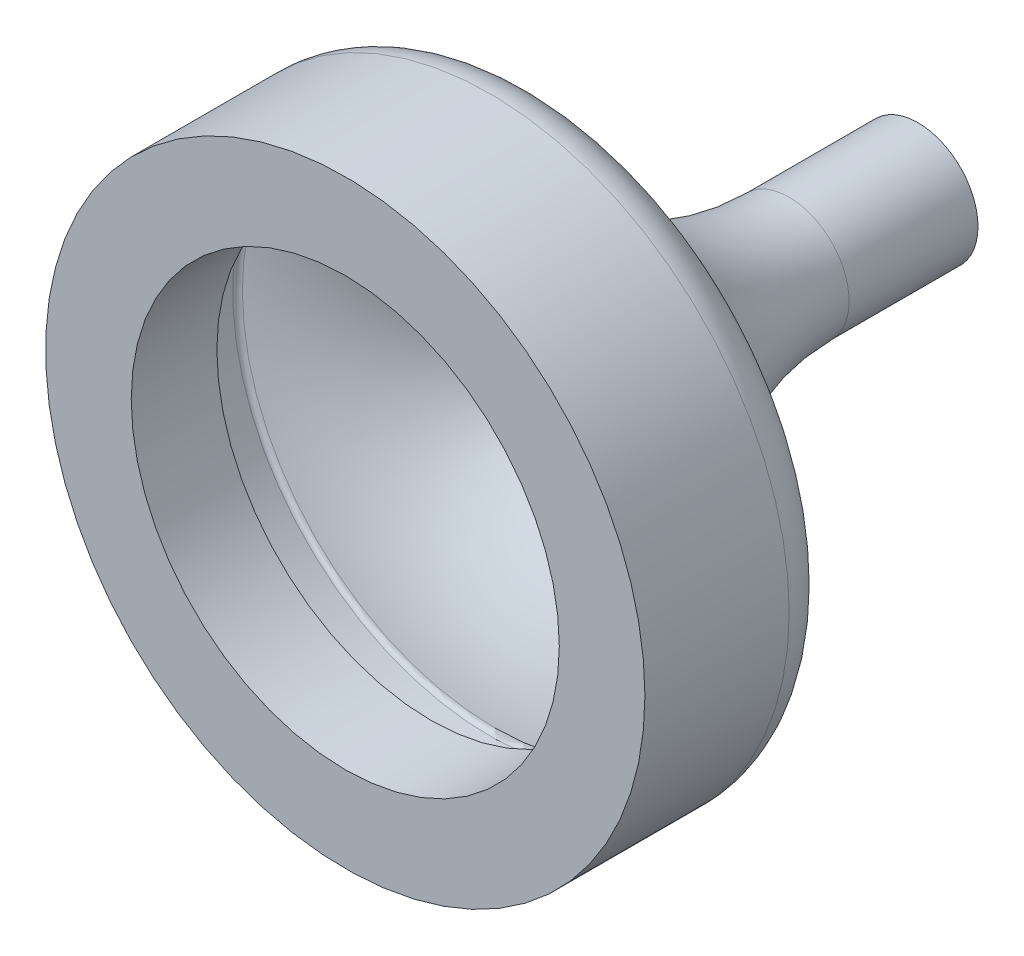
from build123d import *

# Parameters (mm, degrees)
ESQUISSE1_R      = 17.5
ESQUISSE1_R_2    = 12.5
EXTRUSION1_DEPTH = 5


with BuildPart() as part:
    # Esquisse1 → Extrusion1 (new body)
    with BuildSketch(Plane.XY):
        Circle(ESQUISSE1_R)
        Circle(ESQUISSE1_R_2, mode=Mode.SUBTRACT)
    extrude(amount=EXTRUSION1_DEPTH)

    # Esquisse2 → R_volution1 (revolve)
    with BuildSketch(Plane(origin=(0, 0, 0), x_dir=(1, 0, 0), z_dir=(0, 1, 0)), mode=Mode.PRIVATE) as r_volution1_sk:
        with BuildLine():
            Line((-17.5, 0), (-17.5, 3.425845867))
            ThreePointArc((-17.5, 3.425845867), (-16.881777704, 5.187892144), (-15.298155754, 6.177410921))
            ThreePointArc((-15.298155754, 6.177410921), (-6.812624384, 11.479555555), (-3.5, 20.92113911))
            Line((-3.5, 20.92113911), (-3.5, 28.45))
            Line((-3.5, 28.45), (-1, 28.45))
            Line((-1, 28.45), (-1, 20.92113911))
            ThreePointArc((-1, 20.92113911), (-4.860657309, 9.917561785), (-14.750015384, 3.738242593))
            ThreePointArc((-14.750015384, 3.738242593), (-14.929810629, 3.625898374), (-15, 3.425845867))
            Line((-15, 3.425845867), (-15, 0))
            Line((-15, 0), (-17.5, 0))
        make_face()
    revolve(r_volution1_sk.sketch.rotate(Axis((0, 0, 0), (0, 0, -1)), 180), axis=Axis((0, 0, 0), (0, 0, -1)))


solid = part.part
